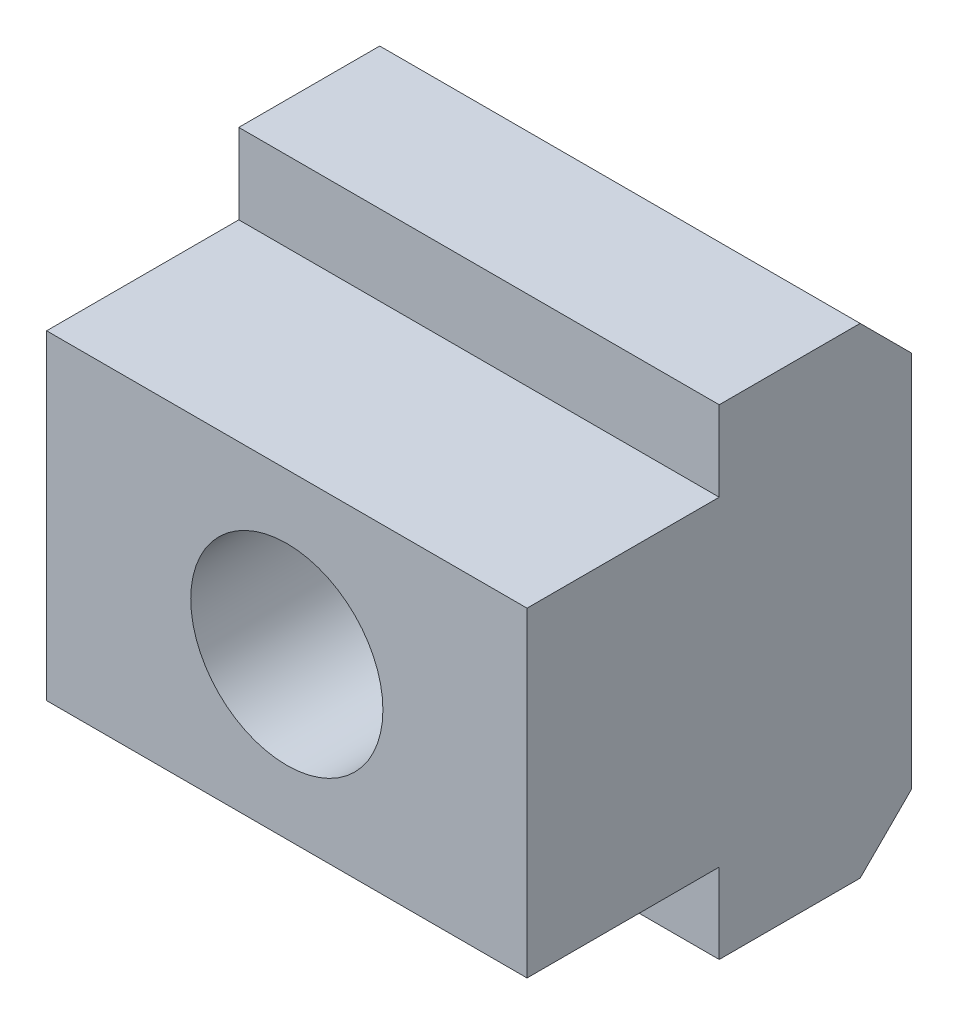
ISO-10303-21;
HEADER;
FILE_DESCRIPTION(('STEP AP214'),'2;1');
FILE_NAME('part.step','',(''),(''),'','','');
FILE_SCHEMA(('AUTOMOTIVE_DESIGN { 1 0 10303 214 1 1 1 1 }'));
ENDSEC;
DATA;
#1=APPLICATION_CONTEXT('core data for automotive mechanical design processes');
#2=APPLICATION_PROTOCOL_DEFINITION('international standard','automotive_design',2000,#1);
#3=PRODUCT_CONTEXT('',#1,'mechanical');
#4=PRODUCT('Part','Part','',(#3));
#5=PRODUCT_RELATED_PRODUCT_CATEGORY('part','',(#4));
#6=PRODUCT_DEFINITION_FORMATION('','',#4);
#7=PRODUCT_DEFINITION_CONTEXT('part definition',#1,'design');
#8=PRODUCT_DEFINITION('design','',#6,#7);
#9=PRODUCT_DEFINITION_SHAPE('','',#8);
#10=(LENGTH_UNIT() NAMED_UNIT(*) SI_UNIT(.MILLI.,.METRE.));
#11=(NAMED_UNIT(*) PLANE_ANGLE_UNIT() SI_UNIT($,.RADIAN.));
#12=(NAMED_UNIT(*) SI_UNIT($,.STERADIAN.) SOLID_ANGLE_UNIT());
#13=UNCERTAINTY_MEASURE_WITH_UNIT(LENGTH_MEASURE(1.E-05),#10,'distance_accuracy_value','');
#14=(GEOMETRIC_REPRESENTATION_CONTEXT(3) GLOBAL_UNCERTAINTY_ASSIGNED_CONTEXT((#13)) GLOBAL_UNIT_ASSIGNED_CONTEXT((#10,
#11,#12)) REPRESENTATION_CONTEXT('',''));
#15=CARTESIAN_POINT('',(0.,0.,0.));
#16=DIRECTION('',(0.,0.,1.));
#17=DIRECTION('',(1.,0.,0.));
#18=AXIS2_PLACEMENT_3D('',#15,#16,#17);
#19=CARTESIAN_POINT('',(7.5,5.,6.));
#20=DIRECTION('',(0.,0.,-1.));
#21=DIRECTION('',(0.,1.,0.));
#22=AXIS2_PLACEMENT_3D('',#19,#20,#21);
#23=PLANE('',#22);
#24=CARTESIAN_POINT('',(0.,0.,6.));
#25=DIRECTION('',(0.,0.,1.));
#26=DIRECTION('',(1.,0.,0.));
#27=AXIS2_PLACEMENT_3D('',#24,#25,#26);
#28=CIRCLE('',#27,3.);
#29=CARTESIAN_POINT('',(3.,0.,6.));
#30=VERTEX_POINT('',#29);
#31=EDGE_CURVE('E172',#30,#30,#28,.T.);
#32=ORIENTED_EDGE('',*,*,#31,.F.);
#33=EDGE_LOOP('',(#32));
#34=FACE_BOUND('',#33,.T.);
#35=DIRECTION('',(-1.,0.,0.));
#36=VECTOR('',#35,1.);
#37=CARTESIAN_POINT('',(7.5,-5.,6.));
#38=LINE('',#37,#36);
#39=CARTESIAN_POINT('',(7.5,-5.,6.));
#40=VERTEX_POINT('',#39);
#41=CARTESIAN_POINT('',(-7.5,-5.,6.));
#42=VERTEX_POINT('',#41);
#43=EDGE_CURVE('E151',#40,#42,#38,.T.);
#44=ORIENTED_EDGE('',*,*,#43,.F.);
#45=DIRECTION('',(0.,-1.,0.));
#46=VECTOR('',#45,1.);
#47=CARTESIAN_POINT('',(7.5,5.,6.));
#48=LINE('',#47,#46);
#49=CARTESIAN_POINT('',(7.5,5.,6.));
#50=VERTEX_POINT('',#49);
#51=EDGE_CURVE('E130',#50,#40,#48,.T.);
#52=ORIENTED_EDGE('',*,*,#51,.F.);
#53=DIRECTION('',(-1.,0.,0.));
#54=VECTOR('',#53,1.);
#55=CARTESIAN_POINT('',(7.5,5.,6.));
#56=LINE('',#55,#54);
#57=CARTESIAN_POINT('',(-7.5,5.,6.));
#58=VERTEX_POINT('',#57);
#59=EDGE_CURVE('E153',#50,#58,#56,.T.);
#60=ORIENTED_EDGE('',*,*,#59,.T.);
#61=DIRECTION('',(0.,-1.,0.));
#62=VECTOR('',#61,1.);
#63=CARTESIAN_POINT('',(-7.5,5.,6.));
#64=LINE('',#63,#62);
#65=EDGE_CURVE('E182',#58,#42,#64,.T.);
#66=ORIENTED_EDGE('',*,*,#65,.T.);
#67=EDGE_LOOP('',(#44,#52,#60,#66));
#68=FACE_BOUND('',#67,.T.);
#69=ADVANCED_FACE('F14',(#34,#68),#23,.F.);
#70=CARTESIAN_POINT('',(7.5,5.9,-6.));
#71=DIRECTION('',(0.,-0.707106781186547,0.707106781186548));
#72=DIRECTION('',(0.,-0.707106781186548,-0.707106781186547));
#73=AXIS2_PLACEMENT_3D('',#70,#71,#72);
#74=PLANE('',#73);
#75=DIRECTION('',(-1.,0.,0.));
#76=VECTOR('',#75,1.);
#77=CARTESIAN_POINT('',(7.5,7.5,-4.4));
#78=LINE('',#77,#76);
#79=CARTESIAN_POINT('',(7.5,7.5,-4.4));
#80=VERTEX_POINT('',#79);
#81=CARTESIAN_POINT('',(-7.5,7.5,-4.4));
#82=VERTEX_POINT('',#81);
#83=EDGE_CURVE('E9',#80,#82,#78,.T.);
#84=ORIENTED_EDGE('',*,*,#83,.F.);
#85=DIRECTION('',(0.,0.707106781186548,0.707106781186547));
#86=VECTOR('',#85,1.);
#87=CARTESIAN_POINT('',(7.5,5.9,-6.));
#88=LINE('',#87,#86);
#89=CARTESIAN_POINT('',(7.5,5.9,-6.));
#90=VERTEX_POINT('',#89);
#91=EDGE_CURVE('E140',#90,#80,#88,.T.);
#92=ORIENTED_EDGE('',*,*,#91,.F.);
#93=DIRECTION('',(-1.,0.,0.));
#94=VECTOR('',#93,1.);
#95=CARTESIAN_POINT('',(7.5,5.9,-6.));
#96=LINE('',#95,#94);
#97=CARTESIAN_POINT('',(-7.5,5.9,-6.));
#98=VERTEX_POINT('',#97);
#99=EDGE_CURVE('E29',#90,#98,#96,.T.);
#100=ORIENTED_EDGE('',*,*,#99,.T.);
#101=DIRECTION('',(0.,0.707106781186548,0.707106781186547));
#102=VECTOR('',#101,1.);
#103=CARTESIAN_POINT('',(-7.5,5.9,-6.));
#104=LINE('',#103,#102);
#105=EDGE_CURVE('E101',#98,#82,#104,.T.);
#106=ORIENTED_EDGE('',*,*,#105,.T.);
#107=EDGE_LOOP('',(#84,#92,#100,#106));
#108=FACE_BOUND('',#107,.T.);
#109=ADVANCED_FACE('F102',(#108),#74,.F.);
#110=CARTESIAN_POINT('',(7.5,7.5,-4.4));
#111=DIRECTION('',(0.,-1.,0.));
#112=DIRECTION('',(0.,0.,-1.));
#113=AXIS2_PLACEMENT_3D('',#110,#111,#112);
#114=PLANE('',#113);
#115=DIRECTION('',(-1.,0.,0.));
#116=VECTOR('',#115,1.);
#117=CARTESIAN_POINT('',(7.5,7.5,0.));
#118=LINE('',#117,#116);
#119=CARTESIAN_POINT('',(7.5,7.5,0.));
#120=VERTEX_POINT('',#119);
#121=CARTESIAN_POINT('',(-7.5,7.5,0.));
#122=VERTEX_POINT('',#121);
#123=EDGE_CURVE('E22',#120,#122,#118,.T.);
#124=ORIENTED_EDGE('',*,*,#123,.F.);
#125=DIRECTION('',(0.,0.,1.));
#126=VECTOR('',#125,1.);
#127=CARTESIAN_POINT('',(7.5,7.5,-4.4));
#128=LINE('',#127,#126);
#129=EDGE_CURVE('E97',#80,#120,#128,.T.);
#130=ORIENTED_EDGE('',*,*,#129,.F.);
#131=ORIENTED_EDGE('',*,*,#83,.T.);
#132=DIRECTION('',(0.,0.,1.));
#133=VECTOR('',#132,1.);
#134=CARTESIAN_POINT('',(-7.5,7.5,-4.4));
#135=LINE('',#134,#133);
#136=EDGE_CURVE('E94',#82,#122,#135,.T.);
#137=ORIENTED_EDGE('',*,*,#136,.T.);
#138=EDGE_LOOP('',(#124,#130,#131,#137));
#139=FACE_BOUND('',#138,.T.);
#140=ADVANCED_FACE('F16',(#139),#114,.F.);
#141=CARTESIAN_POINT('',(7.5,7.5,0.));
#142=DIRECTION('',(0.,0.,-1.));
#143=DIRECTION('',(0.,1.,0.));
#144=AXIS2_PLACEMENT_3D('',#141,#142,#143);
#145=PLANE('',#144);
#146=DIRECTION('',(-1.,0.,0.));
#147=VECTOR('',#146,1.);
#148=CARTESIAN_POINT('',(7.5,5.,0.));
#149=LINE('',#148,#147);
#150=CARTESIAN_POINT('',(7.5,5.,0.));
#151=VERTEX_POINT('',#150);
#152=CARTESIAN_POINT('',(-7.5,5.,0.));
#153=VERTEX_POINT('',#152);
#154=EDGE_CURVE('E155',#151,#153,#149,.T.);
#155=ORIENTED_EDGE('',*,*,#154,.F.);
#156=DIRECTION('',(0.,-1.,0.));
#157=VECTOR('',#156,1.);
#158=CARTESIAN_POINT('',(7.5,7.5,0.));
#159=LINE('',#158,#157);
#160=EDGE_CURVE('E136',#120,#151,#159,.T.);
#161=ORIENTED_EDGE('',*,*,#160,.F.);
#162=ORIENTED_EDGE('',*,*,#123,.T.);
#163=DIRECTION('',(0.,-1.,0.));
#164=VECTOR('',#163,1.);
#165=CARTESIAN_POINT('',(-7.5,7.5,0.));
#166=LINE('',#165,#164);
#167=EDGE_CURVE('E110',#122,#153,#166,.T.);
#168=ORIENTED_EDGE('',*,*,#167,.T.);
#169=EDGE_LOOP('',(#155,#161,#162,#168));
#170=FACE_BOUND('',#169,.T.);
#171=ADVANCED_FACE('F158',(#170),#145,.F.);
#172=CARTESIAN_POINT('',(7.5,5.,0.));
#173=DIRECTION('',(0.,-1.,0.));
#174=DIRECTION('',(0.,0.,-1.));
#175=AXIS2_PLACEMENT_3D('',#172,#173,#174);
#176=PLANE('',#175);
#177=ORIENTED_EDGE('',*,*,#59,.F.);
#178=DIRECTION('',(0.,0.,1.));
#179=VECTOR('',#178,1.);
#180=CARTESIAN_POINT('',(7.5,5.,0.));
#181=LINE('',#180,#179);
#182=EDGE_CURVE('E133',#151,#50,#181,.T.);
#183=ORIENTED_EDGE('',*,*,#182,.F.);
#184=ORIENTED_EDGE('',*,*,#154,.T.);
#185=DIRECTION('',(0.,0.,1.));
#186=VECTOR('',#185,1.);
#187=CARTESIAN_POINT('',(-7.5,5.,0.));
#188=LINE('',#187,#186);
#189=EDGE_CURVE('E112',#153,#58,#188,.T.);
#190=ORIENTED_EDGE('',*,*,#189,.T.);
#191=EDGE_LOOP('',(#177,#183,#184,#190));
#192=FACE_BOUND('',#191,.T.);
#193=ADVANCED_FACE('F187',(#192),#176,.F.);
#194=CARTESIAN_POINT('',(7.5,-5.,6.));
#195=DIRECTION('',(0.,1.,0.));
#196=DIRECTION('',(0.,0.,1.));
#197=AXIS2_PLACEMENT_3D('',#194,#195,#196);
#198=PLANE('',#197);
#199=DIRECTION('',(-1.,0.,0.));
#200=VECTOR('',#199,1.);
#201=CARTESIAN_POINT('',(7.5,-5.,0.));
#202=LINE('',#201,#200);
#203=CARTESIAN_POINT('',(7.5,-5.,0.));
#204=VERTEX_POINT('',#203);
#205=CARTESIAN_POINT('',(-7.5,-5.,0.));
#206=VERTEX_POINT('',#205);
#207=EDGE_CURVE('E149',#204,#206,#202,.T.);
#208=ORIENTED_EDGE('',*,*,#207,.F.);
#209=DIRECTION('',(0.,0.,-1.));
#210=VECTOR('',#209,1.);
#211=CARTESIAN_POINT('',(7.5,-5.,6.));
#212=LINE('',#211,#210);
#213=EDGE_CURVE('E127',#40,#204,#212,.T.);
#214=ORIENTED_EDGE('',*,*,#213,.F.);
#215=ORIENTED_EDGE('',*,*,#43,.T.);
#216=DIRECTION('',(0.,0.,-1.));
#217=VECTOR('',#216,1.);
#218=CARTESIAN_POINT('',(-7.5,-5.,6.));
#219=LINE('',#218,#217);
#220=EDGE_CURVE('E179',#42,#206,#219,.T.);
#221=ORIENTED_EDGE('',*,*,#220,.T.);
#222=EDGE_LOOP('',(#208,#214,#215,#221));
#223=FACE_BOUND('',#222,.T.);
#224=ADVANCED_FACE('F195',(#223),#198,.F.);
#225=CARTESIAN_POINT('',(7.5,-5.,0.));
#226=DIRECTION('',(0.,0.,-1.));
#227=DIRECTION('',(0.,1.,0.));
#228=AXIS2_PLACEMENT_3D('',#225,#226,#227);
#229=PLANE('',#228);
#230=DIRECTION('',(-1.,0.,0.));
#231=VECTOR('',#230,1.);
#232=CARTESIAN_POINT('',(7.5,-7.5,0.));
#233=LINE('',#232,#231);
#234=CARTESIAN_POINT('',(7.5,-7.5,0.));
#235=VERTEX_POINT('',#234);
#236=CARTESIAN_POINT('',(-7.5,-7.5,0.));
#237=VERTEX_POINT('',#236);
#238=EDGE_CURVE('E147',#235,#237,#233,.T.);
#239=ORIENTED_EDGE('',*,*,#238,.F.);
#240=DIRECTION('',(0.,-1.,0.));
#241=VECTOR('',#240,1.);
#242=CARTESIAN_POINT('',(7.5,-5.,0.));
#243=LINE('',#242,#241);
#244=EDGE_CURVE('E124',#204,#235,#243,.T.);
#245=ORIENTED_EDGE('',*,*,#244,.F.);
#246=ORIENTED_EDGE('',*,*,#207,.T.);
#247=DIRECTION('',(0.,-1.,0.));
#248=VECTOR('',#247,1.);
#249=CARTESIAN_POINT('',(-7.5,-5.,0.));
#250=LINE('',#249,#248);
#251=EDGE_CURVE('E176',#206,#237,#250,.T.);
#252=ORIENTED_EDGE('',*,*,#251,.T.);
#253=EDGE_LOOP('',(#239,#245,#246,#252));
#254=FACE_BOUND('',#253,.T.);
#255=ADVANCED_FACE('F197',(#254),#229,.F.);
#256=CARTESIAN_POINT('',(7.5,-7.5,0.));
#257=DIRECTION('',(0.,1.,0.));
#258=DIRECTION('',(0.,0.,1.));
#259=AXIS2_PLACEMENT_3D('',#256,#257,#258);
#260=PLANE('',#259);
#261=DIRECTION('',(-1.,0.,0.));
#262=VECTOR('',#261,1.);
#263=CARTESIAN_POINT('',(7.5,-7.5,-4.4));
#264=LINE('',#263,#262);
#265=CARTESIAN_POINT('',(7.5,-7.5,-4.4));
#266=VERTEX_POINT('',#265);
#267=CARTESIAN_POINT('',(-7.5,-7.5,-4.4));
#268=VERTEX_POINT('',#267);
#269=EDGE_CURVE('E145',#266,#268,#264,.T.);
#270=ORIENTED_EDGE('',*,*,#269,.F.);
#271=DIRECTION('',(0.,0.,-1.));
#272=VECTOR('',#271,1.);
#273=CARTESIAN_POINT('',(7.5,-7.5,0.));
#274=LINE('',#273,#272);
#275=EDGE_CURVE('E121',#235,#266,#274,.T.);
#276=ORIENTED_EDGE('',*,*,#275,.F.);
#277=ORIENTED_EDGE('',*,*,#238,.T.);
#278=DIRECTION('',(0.,0.,-1.));
#279=VECTOR('',#278,1.);
#280=CARTESIAN_POINT('',(-7.5,-7.5,0.));
#281=LINE('',#280,#279);
#282=EDGE_CURVE('E168',#237,#268,#281,.T.);
#283=ORIENTED_EDGE('',*,*,#282,.T.);
#284=EDGE_LOOP('',(#270,#276,#277,#283));
#285=FACE_BOUND('',#284,.T.);
#286=ADVANCED_FACE('F200',(#285),#260,.F.);
#287=CARTESIAN_POINT('',(7.5,-7.5,-4.4));
#288=DIRECTION('',(0.,0.707106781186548,0.707106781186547));
#289=DIRECTION('',(0.,-0.707106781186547,0.707106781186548));
#290=AXIS2_PLACEMENT_3D('',#287,#288,#289);
#291=PLANE('',#290);
#292=DIRECTION('',(-1.,0.,0.));
#293=VECTOR('',#292,1.);
#294=CARTESIAN_POINT('',(7.5,-5.9,-6.));
#295=LINE('',#294,#293);
#296=CARTESIAN_POINT('',(7.5,-5.9,-6.));
#297=VERTEX_POINT('',#296);
#298=CARTESIAN_POINT('',(-7.5,-5.9,-6.));
#299=VERTEX_POINT('',#298);
#300=EDGE_CURVE('E37',#297,#299,#295,.T.);
#301=ORIENTED_EDGE('',*,*,#300,.F.);
#302=DIRECTION('',(0.,0.707106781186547,-0.707106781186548));
#303=VECTOR('',#302,1.);
#304=CARTESIAN_POINT('',(7.5,-7.5,-4.4));
#305=LINE('',#304,#303);
#306=EDGE_CURVE('E119',#266,#297,#305,.T.);
#307=ORIENTED_EDGE('',*,*,#306,.F.);
#308=ORIENTED_EDGE('',*,*,#269,.T.);
#309=DIRECTION('',(0.,0.707106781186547,-0.707106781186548));
#310=VECTOR('',#309,1.);
#311=CARTESIAN_POINT('',(-7.5,-7.5,-4.4));
#312=LINE('',#311,#310);
#313=EDGE_CURVE('E164',#268,#299,#312,.T.);
#314=ORIENTED_EDGE('',*,*,#313,.T.);
#315=EDGE_LOOP('',(#301,#307,#308,#314));
#316=FACE_BOUND('',#315,.T.);
#317=ADVANCED_FACE('F165',(#316),#291,.F.);
#318=CARTESIAN_POINT('',(7.5,-5.9,-6.));
#319=DIRECTION('',(0.,0.,1.));
#320=DIRECTION('',(1.,0.,0.));
#321=AXIS2_PLACEMENT_3D('',#318,#319,#320);
#322=PLANE('',#321);
#323=CARTESIAN_POINT('',(0.,0.,-6.));
#324=DIRECTION('',(0.,0.,1.));
#325=DIRECTION('',(1.,0.,0.));
#326=AXIS2_PLACEMENT_3D('',#323,#324,#325);
#327=CIRCLE('',#326,3.);
#328=CARTESIAN_POINT('',(3.,0.,-6.));
#329=VERTEX_POINT('',#328);
#330=EDGE_CURVE('E105',#329,#329,#327,.T.);
#331=ORIENTED_EDGE('',*,*,#330,.T.);
#332=EDGE_LOOP('',(#331));
#333=FACE_BOUND('',#332,.T.);
#334=DIRECTION('',(0.,1.,0.));
#335=VECTOR('',#334,1.);
#336=CARTESIAN_POINT('',(7.5,-5.9,-6.));
#337=LINE('',#336,#335);
#338=EDGE_CURVE('E116',#297,#90,#337,.T.);
#339=ORIENTED_EDGE('',*,*,#338,.F.);
#340=ORIENTED_EDGE('',*,*,#300,.T.);
#341=DIRECTION('',(0.,1.,0.));
#342=VECTOR('',#341,1.);
#343=CARTESIAN_POINT('',(-7.5,-5.9,-6.));
#344=LINE('',#343,#342);
#345=EDGE_CURVE('E142',#299,#98,#344,.T.);
#346=ORIENTED_EDGE('',*,*,#345,.T.);
#347=ORIENTED_EDGE('',*,*,#99,.F.);
#348=EDGE_LOOP('',(#339,#340,#346,#347));
#349=FACE_BOUND('',#348,.T.);
#350=ADVANCED_FACE('F162',(#333,#349),#322,.F.);
#351=CARTESIAN_POINT('',(7.5,0.,-11.9));
#352=DIRECTION('',(-1.,0.,0.));
#353=DIRECTION('',(0.,0.,1.));
#354=AXIS2_PLACEMENT_3D('',#351,#352,#353);
#355=PLANE('',#354);
#356=ORIENTED_EDGE('',*,*,#91,.T.);
#357=ORIENTED_EDGE('',*,*,#129,.T.);
#358=ORIENTED_EDGE('',*,*,#160,.T.);
#359=ORIENTED_EDGE('',*,*,#182,.T.);
#360=ORIENTED_EDGE('',*,*,#51,.T.);
#361=ORIENTED_EDGE('',*,*,#213,.T.);
#362=ORIENTED_EDGE('',*,*,#244,.T.);
#363=ORIENTED_EDGE('',*,*,#275,.T.);
#364=ORIENTED_EDGE('',*,*,#306,.T.);
#365=ORIENTED_EDGE('',*,*,#338,.T.);
#366=EDGE_LOOP('',(#356,#357,#358,#359,#360,#361,#362,#363,#364,#365));
#367=FACE_BOUND('',#366,.T.);
#368=ADVANCED_FACE('F160',(#367),#355,.F.);
#369=CARTESIAN_POINT('',(-7.5,0.,-11.9));
#370=DIRECTION('',(-1.,0.,0.));
#371=DIRECTION('',(0.,0.,1.));
#372=AXIS2_PLACEMENT_3D('',#369,#370,#371);
#373=PLANE('',#372);
#374=ORIENTED_EDGE('',*,*,#105,.F.);
#375=ORIENTED_EDGE('',*,*,#345,.F.);
#376=ORIENTED_EDGE('',*,*,#313,.F.);
#377=ORIENTED_EDGE('',*,*,#282,.F.);
#378=ORIENTED_EDGE('',*,*,#251,.F.);
#379=ORIENTED_EDGE('',*,*,#220,.F.);
#380=ORIENTED_EDGE('',*,*,#65,.F.);
#381=ORIENTED_EDGE('',*,*,#189,.F.);
#382=ORIENTED_EDGE('',*,*,#167,.F.);
#383=ORIENTED_EDGE('',*,*,#136,.F.);
#384=EDGE_LOOP('',(#374,#375,#376,#377,#378,#379,#380,#381,#382,#383));
#385=FACE_BOUND('',#384,.T.);
#386=ADVANCED_FACE('F107',(#385),#373,.T.);
#387=CARTESIAN_POINT('',(0.,0.,-6.));
#388=DIRECTION('',(0.,0.,1.));
#389=DIRECTION('',(1.,0.,0.));
#390=AXIS2_PLACEMENT_3D('',#387,#388,#389);
#391=CYLINDRICAL_SURFACE('',#390,3.);
#392=ORIENTED_EDGE('',*,*,#330,.F.);
#393=EDGE_LOOP('',(#392));
#394=FACE_BOUND('',#393,.T.);
#395=ORIENTED_EDGE('',*,*,#31,.T.);
#396=EDGE_LOOP('',(#395));
#397=FACE_BOUND('',#396,.T.);
#398=ADVANCED_FACE('F287',(#394,#397),#391,.F.);
#399=CLOSED_SHELL('',(#69,#109,#140,#171,#193,#224,#255,#286,#317,#350,#368,#386,#398));
#400=MANIFOLD_SOLID_BREP('B1',#399);
#401=ADVANCED_BREP_SHAPE_REPRESENTATION('',(#18,#400),#14);
#402=SHAPE_DEFINITION_REPRESENTATION(#9,#401);
ENDSEC;
END-ISO-10303-21;
